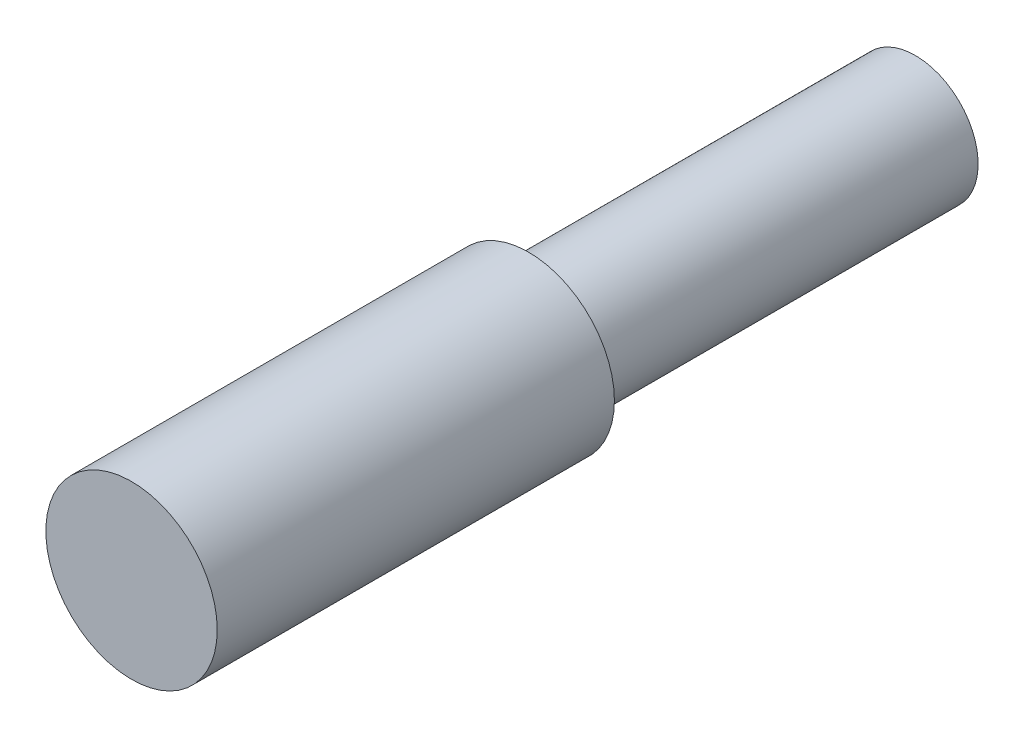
ISO-10303-21;
HEADER;
FILE_DESCRIPTION(('STEP AP214'),'2;1');
FILE_NAME('part.step','',(''),(''),'','','');
FILE_SCHEMA(('AUTOMOTIVE_DESIGN { 1 0 10303 214 1 1 1 1 }'));
ENDSEC;
DATA;
#1=APPLICATION_CONTEXT('core data for automotive mechanical design processes');
#2=APPLICATION_PROTOCOL_DEFINITION('international standard','automotive_design',2000,#1);
#3=PRODUCT_CONTEXT('',#1,'mechanical');
#4=PRODUCT('Part','Part','',(#3));
#5=PRODUCT_RELATED_PRODUCT_CATEGORY('part','',(#4));
#6=PRODUCT_DEFINITION_FORMATION('','',#4);
#7=PRODUCT_DEFINITION_CONTEXT('part definition',#1,'design');
#8=PRODUCT_DEFINITION('design','',#6,#7);
#9=PRODUCT_DEFINITION_SHAPE('','',#8);
#10=(LENGTH_UNIT() NAMED_UNIT(*) SI_UNIT(.MILLI.,.METRE.));
#11=(NAMED_UNIT(*) PLANE_ANGLE_UNIT() SI_UNIT($,.RADIAN.));
#12=(NAMED_UNIT(*) SI_UNIT($,.STERADIAN.) SOLID_ANGLE_UNIT());
#13=UNCERTAINTY_MEASURE_WITH_UNIT(LENGTH_MEASURE(1.E-05),#10,'distance_accuracy_value','');
#14=(GEOMETRIC_REPRESENTATION_CONTEXT(3) GLOBAL_UNCERTAINTY_ASSIGNED_CONTEXT((#13)) GLOBAL_UNIT_ASSIGNED_CONTEXT((#10,
#11,#12)) REPRESENTATION_CONTEXT('',''));
#15=CARTESIAN_POINT('',(0.,0.,0.));
#16=DIRECTION('',(0.,0.,1.));
#17=DIRECTION('',(1.,0.,0.));
#18=AXIS2_PLACEMENT_3D('',#15,#16,#17);
#19=CARTESIAN_POINT('',(0.,0.,19.05));
#20=DIRECTION('',(0.,0.,-1.));
#21=DIRECTION('',(-1.,0.,0.));
#22=AXIS2_PLACEMENT_3D('',#19,#20,#21);
#23=CYLINDRICAL_SURFACE('',#22,1.524);
#24=CARTESIAN_POINT('',(0.,0.,0.));
#25=DIRECTION('',(0.,0.,1.));
#26=DIRECTION('',(1.,0.,0.));
#27=AXIS2_PLACEMENT_3D('',#24,#25,#26);
#28=CIRCLE('',#27,1.524);
#29=CARTESIAN_POINT('',(-1.524,0.,0.));
#30=VERTEX_POINT('',#29);
#31=EDGE_CURVE('E34',#30,#30,#28,.T.);
#32=CARTESIAN_POINT('',(0.,0.,9.398));
#33=DIRECTION('',(0.,0.,1.));
#34=DIRECTION('',(1.,0.,0.));
#35=AXIS2_PLACEMENT_3D('',#32,#33,#34);
#36=CIRCLE('',#35,1.524);
#37=CARTESIAN_POINT('',(-1.524,0.,9.398));
#38=VERTEX_POINT('',#37);
#39=EDGE_CURVE('E10',#38,#38,#36,.T.);
#40=CARTESIAN_POINT('',(-1.524,0.,0.));
#41=CARTESIAN_POINT('',(-1.524,0.,0.0978958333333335));
#42=CARTESIAN_POINT('',(-1.524,0.,0.195791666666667));
#43=CARTESIAN_POINT('',(-1.524,0.,0.391583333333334));
#44=CARTESIAN_POINT('',(-1.524,0.,0.489479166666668));
#45=CARTESIAN_POINT('',(-1.524,0.,0.685270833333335));
#46=CARTESIAN_POINT('',(-1.524,0.,0.783166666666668));
#47=CARTESIAN_POINT('',(-1.524,0.,0.978958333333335));
#48=CARTESIAN_POINT('',(-1.524,0.,1.07685416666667));
#49=CARTESIAN_POINT('',(-1.524,0.,1.27264583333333));
#50=CARTESIAN_POINT('',(-1.524,0.,1.37054166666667));
#51=CARTESIAN_POINT('',(-1.524,0.,1.56633333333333));
#52=CARTESIAN_POINT('',(-1.524,0.,1.66422916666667));
#53=CARTESIAN_POINT('',(-1.524,0.,1.86002083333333));
#54=CARTESIAN_POINT('',(-1.524,0.,1.95791666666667));
#55=CARTESIAN_POINT('',(-1.524,0.,2.15370833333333));
#56=CARTESIAN_POINT('',(-1.524,0.,2.25160416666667));
#57=CARTESIAN_POINT('',(-1.524,0.,2.44739583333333));
#58=CARTESIAN_POINT('',(-1.524,0.,2.54529166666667));
#59=CARTESIAN_POINT('',(-1.524,0.,2.74108333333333));
#60=CARTESIAN_POINT('',(-1.524,0.,2.83897916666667));
#61=CARTESIAN_POINT('',(-1.524,0.,3.03477083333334));
#62=CARTESIAN_POINT('',(-1.524,0.,3.13266666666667));
#63=CARTESIAN_POINT('',(-1.524,0.,3.32845833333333));
#64=CARTESIAN_POINT('',(-1.524,0.,3.42635416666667));
#65=CARTESIAN_POINT('',(-1.524,0.,3.62214583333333));
#66=CARTESIAN_POINT('',(-1.524,0.,3.72004166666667));
#67=CARTESIAN_POINT('',(-1.524,0.,3.91583333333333));
#68=CARTESIAN_POINT('',(-1.524,0.,4.01372916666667));
#69=CARTESIAN_POINT('',(-1.524,0.,4.20952083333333));
#70=CARTESIAN_POINT('',(-1.524,0.,4.30741666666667));
#71=CARTESIAN_POINT('',(-1.524,0.,4.50320833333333));
#72=CARTESIAN_POINT('',(-1.524,0.,4.60110416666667));
#73=CARTESIAN_POINT('',(-1.524,0.,4.79689583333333));
#74=CARTESIAN_POINT('',(-1.524,0.,4.89479166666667));
#75=CARTESIAN_POINT('',(-1.524,0.,5.09058333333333));
#76=CARTESIAN_POINT('',(-1.524,0.,5.18847916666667));
#77=CARTESIAN_POINT('',(-1.524,0.,5.38427083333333));
#78=CARTESIAN_POINT('',(-1.524,0.,5.48216666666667));
#79=CARTESIAN_POINT('',(-1.524,0.,5.67795833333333));
#80=CARTESIAN_POINT('',(-1.524,0.,5.77585416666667));
#81=CARTESIAN_POINT('',(-1.524,0.,5.97164583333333));
#82=CARTESIAN_POINT('',(-1.524,0.,6.06954166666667));
#83=CARTESIAN_POINT('',(-1.524,0.,6.26533333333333));
#84=CARTESIAN_POINT('',(-1.524,0.,6.36322916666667));
#85=CARTESIAN_POINT('',(-1.524,0.,6.55902083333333));
#86=CARTESIAN_POINT('',(-1.524,0.,6.65691666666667));
#87=CARTESIAN_POINT('',(-1.524,0.,6.85270833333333));
#88=CARTESIAN_POINT('',(-1.524,0.,6.95060416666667));
#89=CARTESIAN_POINT('',(-1.524,0.,7.14639583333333));
#90=CARTESIAN_POINT('',(-1.524,0.,7.24429166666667));
#91=CARTESIAN_POINT('',(-1.524,0.,7.44008333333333));
#92=CARTESIAN_POINT('',(-1.524,0.,7.53797916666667));
#93=CARTESIAN_POINT('',(-1.524,0.,7.73377083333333));
#94=CARTESIAN_POINT('',(-1.524,0.,7.83166666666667));
#95=CARTESIAN_POINT('',(-1.524,0.,8.02745833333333));
#96=CARTESIAN_POINT('',(-1.524,0.,8.12535416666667));
#97=CARTESIAN_POINT('',(-1.524,0.,8.32114583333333));
#98=CARTESIAN_POINT('',(-1.524,0.,8.41904166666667));
#99=CARTESIAN_POINT('',(-1.524,0.,8.61483333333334));
#100=CARTESIAN_POINT('',(-1.524,0.,8.71272916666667));
#101=CARTESIAN_POINT('',(-1.524,0.,8.90852083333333));
#102=CARTESIAN_POINT('',(-1.524,0.,9.00641666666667));
#103=CARTESIAN_POINT('',(-1.524,0.,9.20220833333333));
#104=CARTESIAN_POINT('',(-1.524,0.,9.30010416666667));
#105=CARTESIAN_POINT('',(-1.524,0.,9.398));
#106=B_SPLINE_CURVE_WITH_KNOTS('',3,(#40,#41,#42,#43,#44,#45,#46,#47,#48,#49,#50,#51,#52,#53,
#54,#55,#56,#57,#58,#59,#60,#61,#62,#63,#64,#65,#66,#67,#68,#69,#70,#71,#72,#73,#74,#75,#76,#77,
#78,#79,#80,#81,#82,#83,#84,#85,#86,#87,#88,#89,#90,#91,#92,#93,#94,#95,#96,#97,#98,#99,#100,
#101,#102,#103,#104,#105),.UNSPECIFIED.,.F.,.F.,(4,2,2,2,2,2,2,2,2,2,2,2,2,2,2,2,2,2,2,2,2,2,2,
2,2,2,2,2,2,2,2,2,4),(0.,0.293687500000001,0.587375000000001,0.881062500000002,1.17475,
1.4684375,1.762125,2.0558125,2.3495,2.6431875,2.936875,3.2305625,3.52425,3.8179375,4.111625,
4.4053125,4.699,4.9926875,5.286375,5.5800625,5.87375,6.1674375,6.461125,6.7548125,7.0485,
7.3421875,7.635875,7.9295625,8.22325,8.5169375,8.810625,9.1043125,9.398),.UNSPECIFIED.);
#107=EDGE_CURVE('BSEAM28',#30,#38,#106,.T.);
#108=ORIENTED_EDGE('',*,*,#31,.T.);
#109=ORIENTED_EDGE('',*,*,#39,.F.);
#110=ORIENTED_EDGE('',*,*,#107,.T.);
#111=ORIENTED_EDGE('',*,*,#107,.F.);
#112=EDGE_LOOP('',(#108,#110,#109,#111));
#113=FACE_BOUND('',#112,.T.);
#114=ADVANCED_FACE('F28',(#113),#23,.T.);
#115=CARTESIAN_POINT('',(0.,0.,0.));
#116=DIRECTION('',(0.,0.,1.));
#117=DIRECTION('',(1.,0.,0.));
#118=AXIS2_PLACEMENT_3D('',#115,#116,#117);
#119=PLANE('',#118);
#120=ORIENTED_EDGE('',*,*,#31,.F.);
#121=EDGE_LOOP('',(#120));
#122=FACE_BOUND('',#121,.T.);
#123=ADVANCED_FACE('F59',(#122),#119,.F.);
#124=CARTESIAN_POINT('',(0.,0.,9.398));
#125=DIRECTION('',(0.,0.,1.));
#126=DIRECTION('',(1.,0.,0.));
#127=AXIS2_PLACEMENT_3D('',#124,#125,#126);
#128=PLANE('',#127);
#129=CARTESIAN_POINT('',(0.,0.,9.398));
#130=DIRECTION('',(0.,0.,1.));
#131=DIRECTION('',(1.,0.,0.));
#132=AXIS2_PLACEMENT_3D('',#129,#130,#131);
#133=CIRCLE('',#132,2.0828);
#134=CARTESIAN_POINT('',(2.0828,0.,9.398));
#135=VERTEX_POINT('',#134);
#136=EDGE_CURVE('E38',#135,#135,#133,.T.);
#137=ORIENTED_EDGE('',*,*,#136,.F.);
#138=EDGE_LOOP('',(#137));
#139=FACE_BOUND('',#138,.T.);
#140=ORIENTED_EDGE('',*,*,#39,.T.);
#141=EDGE_LOOP('',(#140));
#142=FACE_BOUND('',#141,.T.);
#143=ADVANCED_FACE('F52',(#139,#142),#128,.F.);
#144=CARTESIAN_POINT('',(0.,0.,9.398));
#145=DIRECTION('',(0.,0.,1.));
#146=DIRECTION('',(1.,0.,0.));
#147=AXIS2_PLACEMENT_3D('',#144,#145,#146);
#148=CYLINDRICAL_SURFACE('',#147,2.0828);
#149=ORIENTED_EDGE('',*,*,#136,.T.);
#150=EDGE_LOOP('',(#149));
#151=FACE_BOUND('',#150,.T.);
#152=CARTESIAN_POINT('',(0.,0.,19.05));
#153=DIRECTION('',(0.,0.,1.));
#154=DIRECTION('',(1.,0.,0.));
#155=AXIS2_PLACEMENT_3D('',#152,#153,#154);
#156=CIRCLE('',#155,2.0828);
#157=CARTESIAN_POINT('',(2.0828,0.,19.05));
#158=VERTEX_POINT('',#157);
#159=EDGE_CURVE('E42',#158,#158,#156,.T.);
#160=ORIENTED_EDGE('',*,*,#159,.F.);
#161=EDGE_LOOP('',(#160));
#162=FACE_BOUND('',#161,.T.);
#163=ADVANCED_FACE('F50',(#151,#162),#148,.T.);
#164=CARTESIAN_POINT('',(0.,0.,19.05));
#165=DIRECTION('',(0.,0.,1.));
#166=DIRECTION('',(1.,0.,0.));
#167=AXIS2_PLACEMENT_3D('',#164,#165,#166);
#168=PLANE('',#167);
#169=ORIENTED_EDGE('',*,*,#159,.T.);
#170=EDGE_LOOP('',(#169));
#171=FACE_BOUND('',#170,.T.);
#172=ADVANCED_FACE('F48',(#171),#168,.T.);
#173=CLOSED_SHELL('',(#114,#123,#143,#163,#172));
#174=MANIFOLD_SOLID_BREP('B2',#173);
#175=ADVANCED_BREP_SHAPE_REPRESENTATION('',(#18,#174),#14);
#176=SHAPE_DEFINITION_REPRESENTATION(#9,#175);
ENDSEC;
END-ISO-10303-21;
